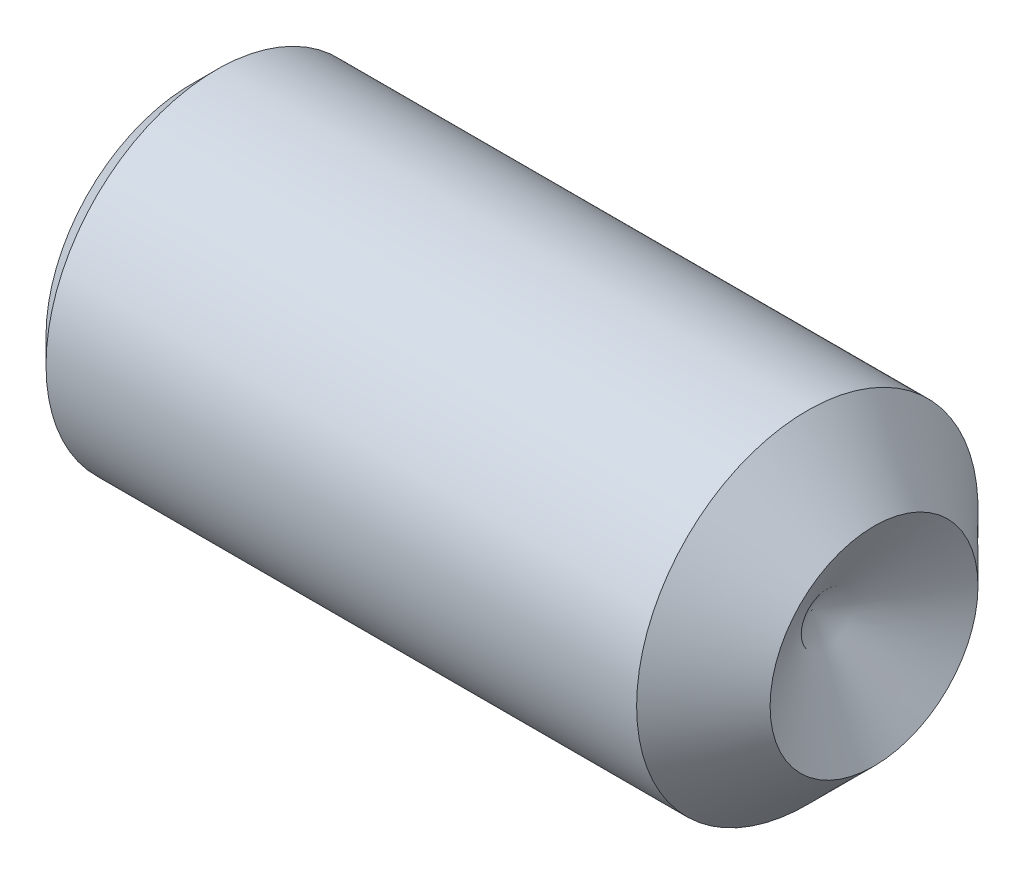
from build123d import *

# Parameters (mm, degrees)
HEX_2_DEPTH = 14.2748


with BuildPart() as part:
    # BodySke → BaseBody (revolve)
    with BuildSketch(Plane.XY, mode=Mode.PRIVATE) as basebody_sk:
        Polygon((0, 0), (0, 10.81024), (1.88976, 12.7), (45.8343, 12.7), (50.8, 7.7343), (46.152763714, 0), align=None)
    revolve(basebody_sk.sketch.rotate(Axis((-12.7, 0, 0), (1, 0, 0)), 90), axis=Axis((-12.7, 0, 0), (1, 0, 0)))

    # Sketch2 → Hex 2 (cut)
    with BuildSketch(Plane.ZY):
        Polygon((4.120779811, 7.1374), (-4.120779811, 7.1374), (-8.241559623, 0), (-4.120779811, -7.1374), (4.120779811, -7.1374), (8.241559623, 0), align=None)
    extrude(amount=-HEX_2_DEPTH, mode=Mode.SUBTRACT)


solid = part.part
